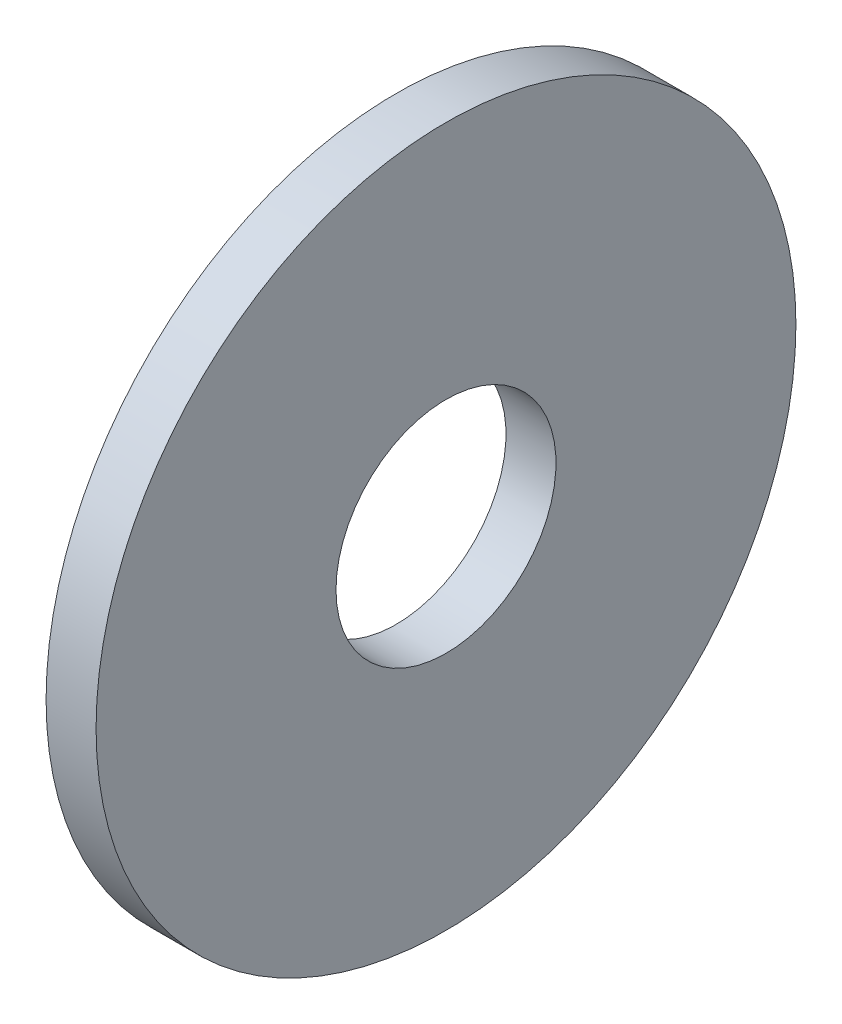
from build123d import *

# Parameters (mm, degrees)
ESQUISSE1_W = 0.5
ESQUISSE1_H = 2.4


with BuildPart() as part:
    # Esquisse1 → Base-R_volution (revolve)
    with BuildSketch(Plane(origin=(0, 0, 0), x_dir=(1, 0, 0), z_dir=(0, 1, 0)), mode=Mode.PRIVATE) as base_r_volution_sk:
        with Locations((0.25, 2.3)):
            Rectangle(ESQUISSE1_W, ESQUISSE1_H)
    revolve(base_r_volution_sk.sketch.rotate(Axis((0, 0, 0), (1, 0, 0)), 180), axis=Axis((0, 0, 0), (1, 0, 0)))


solid = part.part
